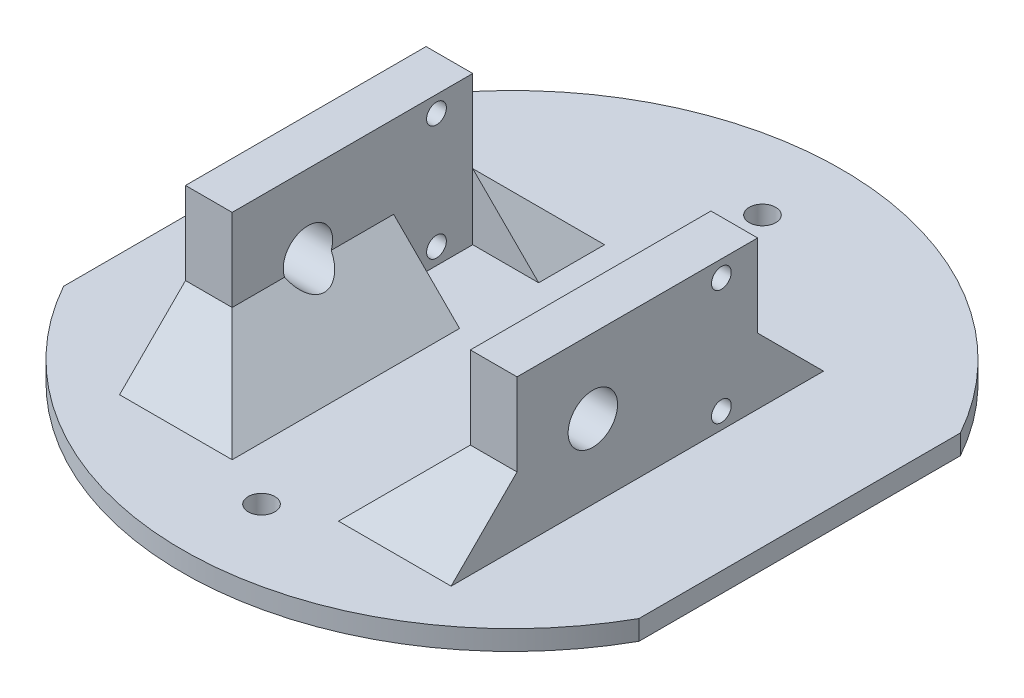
ISO-10303-21;
HEADER;
FILE_DESCRIPTION(('STEP AP214'),'2;1');
FILE_NAME('part.step','',(''),(''),'','','');
FILE_SCHEMA(('AUTOMOTIVE_DESIGN { 1 0 10303 214 1 1 1 1 }'));
ENDSEC;
DATA;
#1=APPLICATION_CONTEXT('core data for automotive mechanical design processes');
#2=APPLICATION_PROTOCOL_DEFINITION('international standard','automotive_design',2000,#1);
#3=PRODUCT_CONTEXT('',#1,'mechanical');
#4=PRODUCT('Part','Part','',(#3));
#5=PRODUCT_RELATED_PRODUCT_CATEGORY('part','',(#4));
#6=PRODUCT_DEFINITION_FORMATION('','',#4);
#7=PRODUCT_DEFINITION_CONTEXT('part definition',#1,'design');
#8=PRODUCT_DEFINITION('design','',#6,#7);
#9=PRODUCT_DEFINITION_SHAPE('','',#8);
#10=(LENGTH_UNIT() NAMED_UNIT(*) SI_UNIT(.MILLI.,.METRE.));
#11=(NAMED_UNIT(*) PLANE_ANGLE_UNIT() SI_UNIT($,.RADIAN.));
#12=(NAMED_UNIT(*) SI_UNIT($,.STERADIAN.) SOLID_ANGLE_UNIT());
#13=UNCERTAINTY_MEASURE_WITH_UNIT(LENGTH_MEASURE(1.E-05),#10,'distance_accuracy_value','');
#14=(GEOMETRIC_REPRESENTATION_CONTEXT(3) GLOBAL_UNCERTAINTY_ASSIGNED_CONTEXT((#13)) GLOBAL_UNIT_ASSIGNED_CONTEXT((#10,
#11,#12)) REPRESENTATION_CONTEXT('',''));
#15=CARTESIAN_POINT('',(0.,0.,0.));
#16=DIRECTION('',(0.,0.,1.));
#17=DIRECTION('',(1.,0.,0.));
#18=AXIS2_PLACEMENT_3D('',#15,#16,#17);
#19=CARTESIAN_POINT('',(43.65,5.49999999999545,-6.61398966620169));
#20=DIRECTION('',(-1.,0.,0.));
#21=DIRECTION('',(0.,0.,1.));
#22=AXIS2_PLACEMENT_3D('',#19,#20,#21);
#23=CYLINDRICAL_SURFACE('',#22,1.49999999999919);
#24=CARTESIAN_POINT('',(25.15,5.49999999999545,-6.61398966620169));
#25=DIRECTION('',(-1.,0.,0.));
#26=DIRECTION('',(0.,0.,1.));
#27=AXIS2_PLACEMENT_3D('',#24,#25,#26);
#28=CIRCLE('',#27,1.49999999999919);
#29=CARTESIAN_POINT('',(25.15,5.49999999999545,-5.1139896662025));
#30=VERTEX_POINT('',#29);
#31=EDGE_CURVE('E352',#30,#30,#28,.T.);
#32=ORIENTED_EDGE('',*,*,#31,.F.);
#33=EDGE_LOOP('',(#32));
#34=FACE_BOUND('',#33,.T.);
#35=CARTESIAN_POINT('',(18.07,5.49999999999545,-6.61398966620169));
#36=DIRECTION('',(-1.,0.,0.));
#37=DIRECTION('',(0.,0.,1.));
#38=AXIS2_PLACEMENT_3D('',#35,#36,#37);
#39=CIRCLE('',#38,1.49999999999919);
#40=CARTESIAN_POINT('',(18.07,5.49999999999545,-5.1139896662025));
#41=VERTEX_POINT('',#40);
#42=EDGE_CURVE('E322',#41,#41,#39,.F.);
#43=ORIENTED_EDGE('',*,*,#42,.F.);
#44=EDGE_LOOP('',(#43));
#45=FACE_BOUND('',#44,.T.);
#46=ADVANCED_FACE('F35',(#34,#45),#23,.F.);
#47=CARTESIAN_POINT('',(-25.15,5.49999999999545,-6.61398966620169));
#48=DIRECTION('',(1.,0.,0.));
#49=DIRECTION('',(0.,0.,-1.));
#50=AXIS2_PLACEMENT_3D('',#47,#48,#49);
#51=CIRCLE('',#50,1.49999999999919);
#52=CARTESIAN_POINT('',(-25.15,5.49999999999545,-8.11398966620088));
#53=VERTEX_POINT('',#52);
#54=EDGE_CURVE('E355',#53,#53,#51,.T.);
#55=ORIENTED_EDGE('',*,*,#54,.F.);
#56=EDGE_LOOP('',(#55));
#57=FACE_BOUND('',#56,.T.);
#58=CARTESIAN_POINT('',(-18.07,5.49999999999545,-6.61398966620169));
#59=DIRECTION('',(1.,0.,0.));
#60=DIRECTION('',(0.,0.,-1.));
#61=AXIS2_PLACEMENT_3D('',#58,#59,#60);
#62=CIRCLE('',#61,1.49999999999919);
#63=CARTESIAN_POINT('',(-18.07,5.49999999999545,-8.11398966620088));
#64=VERTEX_POINT('',#63);
#65=EDGE_CURVE('E232',#64,#64,#62,.F.);
#66=ORIENTED_EDGE('',*,*,#65,.F.);
#67=EDGE_LOOP('',(#66));
#68=FACE_BOUND('',#67,.T.);
#69=ADVANCED_FACE('F455',(#57,#68),#23,.F.);
#70=CARTESIAN_POINT('',(-18.07,13.0000000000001,24.3860103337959));
#71=DIRECTION('',(-0.707106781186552,-0.707106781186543,0.));
#72=DIRECTION('',(0.,0.,-1.));
#73=AXIS2_PLACEMENT_3D('',#70,#71,#72);
#74=PLANE('',#73);
#75=DIRECTION('',(-0.707106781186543,0.707106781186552,0.));
#76=VECTOR('',#75,1.);
#77=CARTESIAN_POINT('',(-18.07,13.0000000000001,-12.1139896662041));
#78=LINE('',#77,#76);
#79=CARTESIAN_POINT('',(-8.07000000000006,3.,-12.1139896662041));
#80=VERTEX_POINT('',#79);
#81=CARTESIAN_POINT('',(-18.07,13.0000000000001,-12.1139896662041));
#82=VERTEX_POINT('',#81);
#83=EDGE_CURVE('E339',#80,#82,#78,.T.);
#84=ORIENTED_EDGE('',*,*,#83,.F.);
#85=DIRECTION('',(0.,0.,1.));
#86=VECTOR('',#85,1.);
#87=CARTESIAN_POINT('',(-8.07000000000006,3.,0.));
#88=LINE('',#87,#86);
#89=CARTESIAN_POINT('',(-8.07000000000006,3.,-22.113989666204));
#90=VERTEX_POINT('',#89);
#91=EDGE_CURVE('E265',#90,#80,#88,.T.);
#92=ORIENTED_EDGE('',*,*,#91,.F.);
#93=DIRECTION('',(-0.577350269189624,0.57735026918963,0.577350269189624));
#94=VECTOR('',#93,1.);
#95=CARTESIAN_POINT('',(-30.2366666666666,25.1666666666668,0.0526770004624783));
#96=LINE('',#95,#94);
#97=EDGE_CURVE('E224',#90,#82,#96,.T.);
#98=ORIENTED_EDGE('',*,*,#97,.T.);
#99=EDGE_LOOP('',(#84,#92,#98));
#100=FACE_BOUND('',#99,.T.);
#101=ADVANCED_FACE('F461',(#100),#74,.F.);
#102=DIRECTION('',(0.,0.,-1.));
#103=VECTOR('',#102,1.);
#104=CARTESIAN_POINT('',(-18.07,13.0000000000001,24.3860103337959));
#105=LINE('',#104,#103);
#106=CARTESIAN_POINT('',(-18.07,13.0000000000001,9.35047642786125));
#107=VERTEX_POINT('',#106);
#108=CARTESIAN_POINT('',(-18.07,13.0000000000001,-0.113989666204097));
#109=VERTEX_POINT('',#108);
#110=EDGE_CURVE('E275',#107,#109,#105,.T.);
#111=ORIENTED_EDGE('',*,*,#110,.F.);
#112=CARTESIAN_POINT('',(-19.3199999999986,14.2499999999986,12.8860103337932));
#113=DIRECTION('',(-0.707106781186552,-0.707106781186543,0.));
#114=DIRECTION('',(0.707106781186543,-0.707106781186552,0.));
#115=AXIS2_PLACEMENT_3D('',#112,#113,#114);
#116=ELLIPSE('',#115,5.30330085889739,3.74999999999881);
#117=CARTESIAN_POINT('',(-18.07,13.0000000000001,16.4215442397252));
#118=VERTEX_POINT('',#117);
#119=EDGE_CURVE('E49',#107,#118,#116,.T.);
#120=ORIENTED_EDGE('',*,*,#119,.T.);
#121=CARTESIAN_POINT('',(-18.07,13.0000000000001,24.3860103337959));
#122=VERTEX_POINT('',#121);
#123=EDGE_CURVE('E276',#122,#118,#105,.T.);
#124=ORIENTED_EDGE('',*,*,#123,.F.);
#125=DIRECTION('',(0.577350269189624,-0.57735026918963,0.577350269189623));
#126=VECTOR('',#125,1.);
#127=CARTESIAN_POINT('',(-18.07,13.0000000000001,24.3860103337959));
#128=LINE('',#127,#126);
#129=CARTESIAN_POINT('',(-8.07000000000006,3.,34.3860103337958));
#130=VERTEX_POINT('',#129);
#131=EDGE_CURVE('E222',#130,#122,#128,.F.);
#132=ORIENTED_EDGE('',*,*,#131,.F.);
#133=CARTESIAN_POINT('',(-8.07000000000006,3.,-0.113989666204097));
#134=VERTEX_POINT('',#133);
#135=EDGE_CURVE('E264',#134,#130,#88,.T.);
#136=ORIENTED_EDGE('',*,*,#135,.F.);
#137=DIRECTION('',(0.707106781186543,-0.707106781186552,0.));
#138=VECTOR('',#137,1.);
#139=CARTESIAN_POINT('',(-18.07,13.0000000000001,-0.113989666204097));
#140=LINE('',#139,#138);
#141=EDGE_CURVE('E336',#109,#134,#140,.T.);
#142=ORIENTED_EDGE('',*,*,#141,.F.);
#143=EDGE_LOOP('',(#111,#120,#124,#132,#136,#142));
#144=FACE_BOUND('',#143,.T.);
#145=ADVANCED_FACE('F649',(#144),#74,.F.);
#146=CARTESIAN_POINT('',(18.07,13.0000000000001,24.3860103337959));
#147=DIRECTION('',(0.707106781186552,-0.707106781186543,0.));
#148=DIRECTION('',(0.,0.,1.));
#149=AXIS2_PLACEMENT_3D('',#146,#147,#148);
#150=PLANE('',#149);
#151=DIRECTION('',(-0.707106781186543,-0.707106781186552,0.));
#152=VECTOR('',#151,1.);
#153=CARTESIAN_POINT('',(18.07,13.0000000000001,-12.1139896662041));
#154=LINE('',#153,#152);
#155=CARTESIAN_POINT('',(18.07,13.0000000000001,-12.1139896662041));
#156=VERTEX_POINT('',#155);
#157=CARTESIAN_POINT('',(8.07000000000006,3.,-12.1139896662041));
#158=VERTEX_POINT('',#157);
#159=EDGE_CURVE('E43',#156,#158,#154,.T.);
#160=ORIENTED_EDGE('',*,*,#159,.F.);
#161=DIRECTION('',(-0.577350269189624,-0.57735026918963,-0.577350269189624));
#162=VECTOR('',#161,1.);
#163=CARTESIAN_POINT('',(30.2366666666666,25.1666666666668,0.0526770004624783));
#164=LINE('',#163,#162);
#165=CARTESIAN_POINT('',(8.07000000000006,3.,-22.113989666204));
#166=VERTEX_POINT('',#165);
#167=EDGE_CURVE('E225',#156,#166,#164,.T.);
#168=ORIENTED_EDGE('',*,*,#167,.T.);
#169=DIRECTION('',(0.,0.,-1.));
#170=VECTOR('',#169,1.);
#171=CARTESIAN_POINT('',(8.07000000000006,3.,0.));
#172=LINE('',#171,#170);
#173=EDGE_CURVE('E246',#158,#166,#172,.T.);
#174=ORIENTED_EDGE('',*,*,#173,.F.);
#175=EDGE_LOOP('',(#160,#168,#174));
#176=FACE_BOUND('',#175,.T.);
#177=ADVANCED_FACE('F37',(#176),#150,.F.);
#178=DIRECTION('',(0.,0.,1.));
#179=VECTOR('',#178,1.);
#180=CARTESIAN_POINT('',(18.07,13.0000000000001,24.3860103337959));
#181=LINE('',#180,#179);
#182=CARTESIAN_POINT('',(18.07,13.0000000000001,16.4215442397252));
#183=VERTEX_POINT('',#182);
#184=CARTESIAN_POINT('',(18.07,13.0000000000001,24.3860103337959));
#185=VERTEX_POINT('',#184);
#186=EDGE_CURVE('E196',#183,#185,#181,.T.);
#187=ORIENTED_EDGE('',*,*,#186,.F.);
#188=CARTESIAN_POINT('',(19.3199999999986,14.2499999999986,12.8860103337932));
#189=DIRECTION('',(0.707106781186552,-0.707106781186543,0.));
#190=DIRECTION('',(0.707106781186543,0.707106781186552,0.));
#191=AXIS2_PLACEMENT_3D('',#188,#189,#190);
#192=ELLIPSE('',#191,5.30330085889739,3.74999999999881);
#193=CARTESIAN_POINT('',(18.07,13.0000000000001,9.35047642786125));
#194=VERTEX_POINT('',#193);
#195=EDGE_CURVE('E56',#183,#194,#192,.T.);
#196=ORIENTED_EDGE('',*,*,#195,.T.);
#197=CARTESIAN_POINT('',(18.07,13.0000000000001,-0.113989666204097));
#198=VERTEX_POINT('',#197);
#199=EDGE_CURVE('E194',#198,#194,#181,.T.);
#200=ORIENTED_EDGE('',*,*,#199,.F.);
#201=DIRECTION('',(0.707106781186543,0.707106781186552,0.));
#202=VECTOR('',#201,1.);
#203=CARTESIAN_POINT('',(18.07,13.0000000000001,-0.113989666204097));
#204=LINE('',#203,#202);
#205=CARTESIAN_POINT('',(8.07000000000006,3.,-0.113989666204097));
#206=VERTEX_POINT('',#205);
#207=EDGE_CURVE('E221',#206,#198,#204,.T.);
#208=ORIENTED_EDGE('',*,*,#207,.F.);
#209=CARTESIAN_POINT('',(8.07000000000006,3.,34.3860103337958));
#210=VERTEX_POINT('',#209);
#211=EDGE_CURVE('E251',#210,#206,#172,.T.);
#212=ORIENTED_EDGE('',*,*,#211,.F.);
#213=DIRECTION('',(0.577350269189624,0.57735026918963,-0.577350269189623));
#214=VECTOR('',#213,1.);
#215=CARTESIAN_POINT('',(18.07,13.0000000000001,24.3860103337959));
#216=LINE('',#215,#214);
#217=EDGE_CURVE('E229',#185,#210,#216,.F.);
#218=ORIENTED_EDGE('',*,*,#217,.F.);
#219=EDGE_LOOP('',(#187,#196,#200,#208,#212,#218));
#220=FACE_BOUND('',#219,.T.);
#221=ADVANCED_FACE('F192',(#220),#150,.F.);
#222=CARTESIAN_POINT('',(0.,3.,0.));
#223=DIRECTION('',(0.,1.,0.));
#224=DIRECTION('',(0.,0.,1.));
#225=AXIS2_PLACEMENT_3D('',#222,#223,#224);
#226=PLANE('',#225);
#227=DIRECTION('',(-1.,0.,0.));
#228=VECTOR('',#227,1.);
#229=CARTESIAN_POINT('',(18.07,3.,-12.1139896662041));
#230=LINE('',#229,#228);
#231=CARTESIAN_POINT('',(18.07,3.,-12.1139896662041));
#232=VERTEX_POINT('',#231);
#233=EDGE_CURVE('E240',#232,#158,#230,.T.);
#234=ORIENTED_EDGE('',*,*,#233,.T.);
#235=ORIENTED_EDGE('',*,*,#173,.T.);
#236=DIRECTION('',(1.,0.,0.));
#237=VECTOR('',#236,1.);
#238=CARTESIAN_POINT('',(0.,3.,-22.113989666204));
#239=LINE('',#238,#237);
#240=CARTESIAN_POINT('',(25.15,3.,-22.113989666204));
#241=VERTEX_POINT('',#240);
#242=EDGE_CURVE('E255',#166,#241,#239,.T.);
#243=ORIENTED_EDGE('',*,*,#242,.T.);
#244=DIRECTION('',(0.,0.,-1.));
#245=VECTOR('',#244,1.);
#246=CARTESIAN_POINT('',(25.15,3.,24.3860103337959));
#247=LINE('',#246,#245);
#248=CARTESIAN_POINT('',(25.15,3.,34.3860103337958));
#249=VERTEX_POINT('',#248);
#250=EDGE_CURVE('E304',#249,#241,#247,.T.);
#251=ORIENTED_EDGE('',*,*,#250,.F.);
#252=DIRECTION('',(-1.,0.,0.));
#253=VECTOR('',#252,1.);
#254=CARTESIAN_POINT('',(0.,3.,34.3860103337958));
#255=LINE('',#254,#253);
#256=EDGE_CURVE('E262',#249,#210,#255,.T.);
#257=ORIENTED_EDGE('',*,*,#256,.T.);
#258=ORIENTED_EDGE('',*,*,#211,.T.);
#259=DIRECTION('',(1.,0.,0.));
#260=VECTOR('',#259,1.);
#261=CARTESIAN_POINT('',(18.07,3.,-0.113989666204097));
#262=LINE('',#261,#260);
#263=CARTESIAN_POINT('',(18.07,3.,-0.113989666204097));
#264=VERTEX_POINT('',#263);
#265=EDGE_CURVE('E316',#206,#264,#262,.T.);
#266=ORIENTED_EDGE('',*,*,#265,.T.);
#267=DIRECTION('',(0.,0.,-1.));
#268=VECTOR('',#267,1.);
#269=CARTESIAN_POINT('',(18.07,3.,-12.1139896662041));
#270=LINE('',#269,#268);
#271=EDGE_CURVE('E317',#264,#232,#270,.T.);
#272=ORIENTED_EDGE('',*,*,#271,.T.);
#273=EDGE_LOOP('',(#234,#235,#243,#251,#257,#258,#266,#272));
#274=FACE_BOUND('',#273,.T.);
#275=ORIENTED_EDGE('',*,*,#91,.T.);
#276=CARTESIAN_POINT('',(-18.07,3.,-12.1139896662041));
#277=VERTEX_POINT('',#276);
#278=EDGE_CURVE('E325',#80,#277,#230,.T.);
#279=ORIENTED_EDGE('',*,*,#278,.T.);
#280=DIRECTION('',(0.,0.,1.));
#281=VECTOR('',#280,1.);
#282=CARTESIAN_POINT('',(-18.07,3.,-12.1139896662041));
#283=LINE('',#282,#281);
#284=CARTESIAN_POINT('',(-18.07,3.,-0.113989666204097));
#285=VERTEX_POINT('',#284);
#286=EDGE_CURVE('E320',#277,#285,#283,.T.);
#287=ORIENTED_EDGE('',*,*,#286,.T.);
#288=EDGE_CURVE('E319',#285,#134,#262,.T.);
#289=ORIENTED_EDGE('',*,*,#288,.T.);
#290=ORIENTED_EDGE('',*,*,#135,.T.);
#291=DIRECTION('',(-1.,0.,0.));
#292=VECTOR('',#291,1.);
#293=CARTESIAN_POINT('',(0.,3.,34.3860103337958));
#294=LINE('',#293,#292);
#295=CARTESIAN_POINT('',(-25.15,3.,34.3860103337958));
#296=VERTEX_POINT('',#295);
#297=EDGE_CURVE('E270',#130,#296,#294,.T.);
#298=ORIENTED_EDGE('',*,*,#297,.T.);
#299=DIRECTION('',(0.,0.,1.));
#300=VECTOR('',#299,1.);
#301=CARTESIAN_POINT('',(-25.15,3.,24.3860103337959));
#302=LINE('',#301,#300);
#303=CARTESIAN_POINT('',(-25.15,3.,-22.113989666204));
#304=VERTEX_POINT('',#303);
#305=EDGE_CURVE('E379',#304,#296,#302,.T.);
#306=ORIENTED_EDGE('',*,*,#305,.F.);
#307=DIRECTION('',(1.,0.,0.));
#308=VECTOR('',#307,1.);
#309=CARTESIAN_POINT('',(0.,3.,-22.113989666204));
#310=LINE('',#309,#308);
#311=EDGE_CURVE('E268',#304,#90,#310,.T.);
#312=ORIENTED_EDGE('',*,*,#311,.T.);
#313=EDGE_LOOP('',(#275,#279,#287,#289,#290,#298,#306,#312));
#314=FACE_BOUND('',#313,.T.);
#315=CARTESIAN_POINT('',(0.,3.,-38.));
#316=DIRECTION('',(0.,1.,0.));
#317=DIRECTION('',(0.,0.,1.));
#318=AXIS2_PLACEMENT_3D('',#315,#316,#317);
#319=CIRCLE('',#318,2.01929999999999);
#320=CARTESIAN_POINT('',(0.,3.,-35.9807));
#321=VERTEX_POINT('',#320);
#322=EDGE_CURVE('E358',#321,#321,#319,.T.);
#323=ORIENTED_EDGE('',*,*,#322,.F.);
#324=EDGE_LOOP('',(#323));
#325=FACE_BOUND('',#324,.T.);
#326=CARTESIAN_POINT('',(0.,3.,38.));
#327=DIRECTION('',(0.,1.,0.));
#328=DIRECTION('',(0.,0.,1.));
#329=AXIS2_PLACEMENT_3D('',#326,#327,#328);
#330=CIRCLE('',#329,2.01929999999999);
#331=CARTESIAN_POINT('',(0.,3.,40.0193));
#332=VERTEX_POINT('',#331);
#333=EDGE_CURVE('E364',#332,#332,#330,.T.);
#334=ORIENTED_EDGE('',*,*,#333,.F.);
#335=EDGE_LOOP('',(#334));
#336=FACE_BOUND('',#335,.T.);
#337=DIRECTION('',(0.,0.,-1.));
#338=VECTOR('',#337,1.);
#339=CARTESIAN_POINT('',(-43.65,3.,-24.3860103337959));
#340=LINE('',#339,#338);
#341=CARTESIAN_POINT('',(-43.65,3.,24.3860103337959));
#342=VERTEX_POINT('',#341);
#343=CARTESIAN_POINT('',(-43.65,3.,-24.3860103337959));
#344=VERTEX_POINT('',#343);
#345=EDGE_CURVE('E403',#342,#344,#340,.T.);
#346=ORIENTED_EDGE('',*,*,#345,.F.);
#347=CARTESIAN_POINT('',(0.,3.,0.));
#348=DIRECTION('',(0.,1.,0.));
#349=DIRECTION('',(0.,0.,1.));
#350=AXIS2_PLACEMENT_3D('',#347,#348,#349);
#351=CIRCLE('',#350,50.);
#352=CARTESIAN_POINT('',(43.65,3.,24.3860103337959));
#353=VERTEX_POINT('',#352);
#354=EDGE_CURVE('E417',#342,#353,#351,.T.);
#355=ORIENTED_EDGE('',*,*,#354,.T.);
#356=DIRECTION('',(0.,0.,1.));
#357=VECTOR('',#356,1.);
#358=CARTESIAN_POINT('',(43.65,3.,-24.3860103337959));
#359=LINE('',#358,#357);
#360=CARTESIAN_POINT('',(43.65,3.,-24.3860103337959));
#361=VERTEX_POINT('',#360);
#362=EDGE_CURVE('E402',#361,#353,#359,.T.);
#363=ORIENTED_EDGE('',*,*,#362,.F.);
#364=EDGE_CURVE('E420',#361,#344,#351,.T.);
#365=ORIENTED_EDGE('',*,*,#364,.T.);
#366=EDGE_LOOP('',(#346,#355,#363,#365));
#367=FACE_BOUND('',#366,.T.);
#368=ADVANCED_FACE('F302',(#274,#314,#325,#336,#367),#226,.T.);
#369=CARTESIAN_POINT('',(0.,3.,0.));
#370=DIRECTION('',(0.,-1.,0.));
#371=DIRECTION('',(0.,0.,-1.));
#372=AXIS2_PLACEMENT_3D('',#369,#370,#371);
#373=CYLINDRICAL_SURFACE('',#372,50.);
#374=CARTESIAN_POINT('',(0.,0.,0.));
#375=DIRECTION('',(0.,1.,0.));
#376=DIRECTION('',(0.,0.,1.));
#377=AXIS2_PLACEMENT_3D('',#374,#375,#376);
#378=CIRCLE('',#377,50.);
#379=CARTESIAN_POINT('',(43.65,0.,-24.3860103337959));
#380=VERTEX_POINT('',#379);
#381=CARTESIAN_POINT('',(-43.65,0.,-24.3860103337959));
#382=VERTEX_POINT('',#381);
#383=EDGE_CURVE('E421',#380,#382,#378,.T.);
#384=ORIENTED_EDGE('',*,*,#383,.T.);
#385=DIRECTION('',(0.,1.,0.));
#386=VECTOR('',#385,1.);
#387=CARTESIAN_POINT('',(-43.65,-35.1,-24.3860103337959));
#388=LINE('',#387,#386);
#389=EDGE_CURVE('E407',#382,#344,#388,.T.);
#390=ORIENTED_EDGE('',*,*,#389,.T.);
#391=ORIENTED_EDGE('',*,*,#364,.F.);
#392=DIRECTION('',(0.,1.,0.));
#393=VECTOR('',#392,1.);
#394=CARTESIAN_POINT('',(43.65,-35.1,-24.3860103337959));
#395=LINE('',#394,#393);
#396=EDGE_CURVE('E413',#380,#361,#395,.T.);
#397=ORIENTED_EDGE('',*,*,#396,.F.);
#398=EDGE_LOOP('',(#384,#390,#391,#397));
#399=FACE_BOUND('',#398,.T.);
#400=ADVANCED_FACE('F626',(#399),#373,.T.);
#401=ORIENTED_EDGE('',*,*,#354,.F.);
#402=DIRECTION('',(0.,1.,0.));
#403=VECTOR('',#402,1.);
#404=CARTESIAN_POINT('',(-43.65,-35.1,24.3860103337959));
#405=LINE('',#404,#403);
#406=CARTESIAN_POINT('',(-43.65,0.,24.3860103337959));
#407=VERTEX_POINT('',#406);
#408=EDGE_CURVE('E405',#407,#342,#405,.T.);
#409=ORIENTED_EDGE('',*,*,#408,.F.);
#410=CARTESIAN_POINT('',(43.65,0.,24.3860103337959));
#411=VERTEX_POINT('',#410);
#412=EDGE_CURVE('E410',#407,#411,#378,.T.);
#413=ORIENTED_EDGE('',*,*,#412,.T.);
#414=DIRECTION('',(0.,1.,0.));
#415=VECTOR('',#414,1.);
#416=CARTESIAN_POINT('',(43.65,-35.1,24.3860103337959));
#417=LINE('',#416,#415);
#418=EDGE_CURVE('E406',#411,#353,#417,.T.);
#419=ORIENTED_EDGE('',*,*,#418,.T.);
#420=EDGE_LOOP('',(#401,#409,#413,#419));
#421=FACE_BOUND('',#420,.T.);
#422=ADVANCED_FACE('F740',(#421),#373,.T.);
#423=CARTESIAN_POINT('',(0.,0.,0.));
#424=DIRECTION('',(0.,1.,0.));
#425=DIRECTION('',(0.,0.,1.));
#426=AXIS2_PLACEMENT_3D('',#423,#424,#425);
#427=PLANE('',#426);
#428=CARTESIAN_POINT('',(0.,0.,-38.));
#429=DIRECTION('',(0.,1.,0.));
#430=DIRECTION('',(0.,0.,1.));
#431=AXIS2_PLACEMENT_3D('',#428,#429,#430);
#432=CIRCLE('',#431,2.01929999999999);
#433=CARTESIAN_POINT('',(0.,0.,-35.9807));
#434=VERTEX_POINT('',#433);
#435=EDGE_CURVE('E361',#434,#434,#432,.T.);
#436=ORIENTED_EDGE('',*,*,#435,.T.);
#437=EDGE_LOOP('',(#436));
#438=FACE_BOUND('',#437,.T.);
#439=CARTESIAN_POINT('',(0.,0.,38.));
#440=DIRECTION('',(0.,1.,0.));
#441=DIRECTION('',(0.,0.,1.));
#442=AXIS2_PLACEMENT_3D('',#439,#440,#441);
#443=CIRCLE('',#442,2.01929999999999);
#444=CARTESIAN_POINT('',(0.,0.,40.0193));
#445=VERTEX_POINT('',#444);
#446=EDGE_CURVE('E309',#445,#445,#443,.T.);
#447=ORIENTED_EDGE('',*,*,#446,.T.);
#448=EDGE_LOOP('',(#447));
#449=FACE_BOUND('',#448,.T.);
#450=ORIENTED_EDGE('',*,*,#412,.F.);
#451=DIRECTION('',(0.,0.,-1.));
#452=VECTOR('',#451,1.);
#453=CARTESIAN_POINT('',(-43.65,0.,0.));
#454=LINE('',#453,#452);
#455=EDGE_CURVE('E257',#407,#382,#454,.T.);
#456=ORIENTED_EDGE('',*,*,#455,.T.);
#457=ORIENTED_EDGE('',*,*,#383,.F.);
#458=DIRECTION('',(0.,0.,1.));
#459=VECTOR('',#458,1.);
#460=CARTESIAN_POINT('',(43.65,0.,0.));
#461=LINE('',#460,#459);
#462=EDGE_CURVE('E424',#380,#411,#461,.T.);
#463=ORIENTED_EDGE('',*,*,#462,.T.);
#464=EDGE_LOOP('',(#450,#456,#457,#463));
#465=FACE_BOUND('',#464,.T.);
#466=ADVANCED_FACE('F732',(#438,#449,#465),#427,.F.);
#467=CARTESIAN_POINT('',(43.65,-35.1,-24.3860103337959));
#468=DIRECTION('',(-1.,0.,0.));
#469=DIRECTION('',(0.,0.,1.));
#470=AXIS2_PLACEMENT_3D('',#467,#468,#469);
#471=PLANE('',#470);
#472=ORIENTED_EDGE('',*,*,#396,.T.);
#473=ORIENTED_EDGE('',*,*,#362,.T.);
#474=ORIENTED_EDGE('',*,*,#418,.F.);
#475=ORIENTED_EDGE('',*,*,#462,.F.);
#476=EDGE_LOOP('',(#472,#473,#474,#475));
#477=FACE_BOUND('',#476,.T.);
#478=ADVANCED_FACE('F724',(#477),#471,.F.);
#479=CARTESIAN_POINT('',(-43.65,-35.1,-24.3860103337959));
#480=DIRECTION('',(1.,0.,0.));
#481=DIRECTION('',(0.,0.,-1.));
#482=AXIS2_PLACEMENT_3D('',#479,#480,#481);
#483=PLANE('',#482);
#484=ORIENTED_EDGE('',*,*,#408,.T.);
#485=ORIENTED_EDGE('',*,*,#345,.T.);
#486=ORIENTED_EDGE('',*,*,#389,.F.);
#487=ORIENTED_EDGE('',*,*,#455,.F.);
#488=EDGE_LOOP('',(#484,#485,#486,#487));
#489=FACE_BOUND('',#488,.T.);
#490=ADVANCED_FACE('F695',(#489),#483,.F.);
#491=CARTESIAN_POINT('',(-25.15,25.5,24.3860103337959));
#492=DIRECTION('',(1.,0.,0.));
#493=DIRECTION('',(0.,0.,-1.));
#494=AXIS2_PLACEMENT_3D('',#491,#492,#493);
#495=PLANE('',#494);
#496=CARTESIAN_POINT('',(-25.15,14.2499999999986,12.8860103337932));
#497=DIRECTION('',(1.,0.,0.));
#498=DIRECTION('',(0.,0.,-1.));
#499=AXIS2_PLACEMENT_3D('',#496,#497,#498);
#500=CIRCLE('',#499,3.74999999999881);
#501=CARTESIAN_POINT('',(-25.15,14.2499999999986,9.13601033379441));
#502=VERTEX_POINT('',#501);
#503=EDGE_CURVE('E198',#502,#502,#500,.F.);
#504=ORIENTED_EDGE('',*,*,#503,.F.);
#505=EDGE_LOOP('',(#504));
#506=FACE_BOUND('',#505,.T.);
#507=ORIENTED_EDGE('',*,*,#54,.T.);
#508=EDGE_LOOP('',(#507));
#509=FACE_BOUND('',#508,.T.);
#510=CARTESIAN_POINT('',(-25.15,22.9999999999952,-6.61398966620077));
#511=DIRECTION('',(1.,0.,0.));
#512=DIRECTION('',(0.,0.,-1.));
#513=AXIS2_PLACEMENT_3D('',#510,#511,#512);
#514=CIRCLE('',#513,1.49999999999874);
#515=CARTESIAN_POINT('',(-25.15,22.9999999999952,-5.11398966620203));
#516=VERTEX_POINT('',#515);
#517=EDGE_CURVE('E349',#516,#516,#514,.T.);
#518=ORIENTED_EDGE('',*,*,#517,.T.);
#519=EDGE_LOOP('',(#518));
#520=FACE_BOUND('',#519,.T.);
#521=ORIENTED_EDGE('',*,*,#305,.T.);
#522=DIRECTION('',(0.,0.707106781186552,-0.707106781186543));
#523=VECTOR('',#522,1.);
#524=CARTESIAN_POINT('',(-25.15,19.2500000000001,18.1360103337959));
#525=LINE('',#524,#523);
#526=CARTESIAN_POINT('',(-25.15,13.0000000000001,24.3860103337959));
#527=VERTEX_POINT('',#526);
#528=EDGE_CURVE('E206',#296,#527,#525,.T.);
#529=ORIENTED_EDGE('',*,*,#528,.T.);
#530=DIRECTION('',(0.,-1.,0.));
#531=VECTOR('',#530,1.);
#532=CARTESIAN_POINT('',(-25.15,25.5,24.3860103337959));
#533=LINE('',#532,#531);
#534=CARTESIAN_POINT('',(-25.15,25.5,24.3860103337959));
#535=VERTEX_POINT('',#534);
#536=EDGE_CURVE('E399',#535,#527,#533,.T.);
#537=ORIENTED_EDGE('',*,*,#536,.F.);
#538=DIRECTION('',(0.,0.,1.));
#539=VECTOR('',#538,1.);
#540=CARTESIAN_POINT('',(-25.15,25.5,24.3860103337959));
#541=LINE('',#540,#539);
#542=CARTESIAN_POINT('',(-25.15,25.5,-12.1139896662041));
#543=VERTEX_POINT('',#542);
#544=EDGE_CURVE('E380',#543,#535,#541,.T.);
#545=ORIENTED_EDGE('',*,*,#544,.F.);
#546=DIRECTION('',(0.,-1.,0.));
#547=VECTOR('',#546,1.);
#548=CARTESIAN_POINT('',(-25.15,25.5,-12.1139896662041));
#549=LINE('',#548,#547);
#550=CARTESIAN_POINT('',(-25.15,13.0000000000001,-12.1139896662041));
#551=VERTEX_POINT('',#550);
#552=EDGE_CURVE('E389',#543,#551,#549,.T.);
#553=ORIENTED_EDGE('',*,*,#552,.T.);
#554=DIRECTION('',(0.,-0.707106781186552,-0.707106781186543));
#555=VECTOR('',#554,1.);
#556=CARTESIAN_POINT('',(-25.15,37.5000000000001,12.3860103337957));
#557=LINE('',#556,#555);
#558=EDGE_CURVE('E208',#551,#304,#557,.T.);
#559=ORIENTED_EDGE('',*,*,#558,.T.);
#560=EDGE_LOOP('',(#521,#529,#537,#545,#553,#559));
#561=FACE_BOUND('',#560,.T.);
#562=ADVANCED_FACE('F692',(#506,#509,#520,#561),#495,.F.);
#563=CARTESIAN_POINT('',(-25.15,25.5,24.3860103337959));
#564=DIRECTION('',(0.,0.,-1.));
#565=DIRECTION('',(-1.,0.,0.));
#566=AXIS2_PLACEMENT_3D('',#563,#564,#565);
#567=PLANE('',#566);
#568=ORIENTED_EDGE('',*,*,#536,.T.);
#569=DIRECTION('',(1.,0.,0.));
#570=VECTOR('',#569,1.);
#571=CARTESIAN_POINT('',(-25.15,13.0000000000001,24.3860103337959));
#572=LINE('',#571,#570);
#573=EDGE_CURVE('E252',#527,#122,#572,.T.);
#574=ORIENTED_EDGE('',*,*,#573,.T.);
#575=DIRECTION('',(0.,-1.,0.));
#576=VECTOR('',#575,1.);
#577=CARTESIAN_POINT('',(-18.07,25.5,24.3860103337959));
#578=LINE('',#577,#576);
#579=CARTESIAN_POINT('',(-18.07,25.5,24.3860103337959));
#580=VERTEX_POINT('',#579);
#581=EDGE_CURVE('E396',#580,#122,#578,.T.);
#582=ORIENTED_EDGE('',*,*,#581,.F.);
#583=DIRECTION('',(1.,0.,0.));
#584=VECTOR('',#583,1.);
#585=CARTESIAN_POINT('',(-25.15,25.5,24.3860103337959));
#586=LINE('',#585,#584);
#587=EDGE_CURVE('E383',#535,#580,#586,.T.);
#588=ORIENTED_EDGE('',*,*,#587,.F.);
#589=EDGE_LOOP('',(#568,#574,#582,#588));
#590=FACE_BOUND('',#589,.T.);
#591=ADVANCED_FACE('F611',(#590),#567,.F.);
#592=CARTESIAN_POINT('',(-18.07,25.5,24.3860103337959));
#593=DIRECTION('',(-1.,0.,0.));
#594=DIRECTION('',(0.,0.,1.));
#595=AXIS2_PLACEMENT_3D('',#592,#593,#594);
#596=PLANE('',#595);
#597=CARTESIAN_POINT('',(-18.07,22.9999999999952,-6.61398966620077));
#598=DIRECTION('',(-1.,0.,0.));
#599=DIRECTION('',(0.,0.,1.));
#600=AXIS2_PLACEMENT_3D('',#597,#598,#599);
#601=CIRCLE('',#600,1.49999999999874);
#602=CARTESIAN_POINT('',(-18.07,22.9999999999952,-5.11398966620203));
#603=VERTEX_POINT('',#602);
#604=EDGE_CURVE('E346',#603,#603,#601,.T.);
#605=ORIENTED_EDGE('',*,*,#604,.T.);
#606=EDGE_LOOP('',(#605));
#607=FACE_BOUND('',#606,.T.);
#608=ORIENTED_EDGE('',*,*,#123,.T.);
#609=CARTESIAN_POINT('',(-18.07,14.2499999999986,12.8860103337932));
#610=DIRECTION('',(-1.,0.,0.));
#611=DIRECTION('',(0.,0.,1.));
#612=AXIS2_PLACEMENT_3D('',#609,#610,#611);
#613=CIRCLE('',#612,3.74999999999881);
#614=EDGE_CURVE('E197',#118,#107,#613,.T.);
#615=ORIENTED_EDGE('',*,*,#614,.T.);
#616=ORIENTED_EDGE('',*,*,#110,.T.);
#617=DIRECTION('',(0.,1.,0.));
#618=VECTOR('',#617,1.);
#619=CARTESIAN_POINT('',(-18.07,-35.0801733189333,-0.113989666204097));
#620=LINE('',#619,#618);
#621=EDGE_CURVE('E326',#285,#109,#620,.T.);
#622=ORIENTED_EDGE('',*,*,#621,.F.);
#623=ORIENTED_EDGE('',*,*,#286,.F.);
#624=DIRECTION('',(0.,1.,0.));
#625=VECTOR('',#624,1.);
#626=CARTESIAN_POINT('',(-18.07,-35.0801733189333,-12.1139896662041));
#627=LINE('',#626,#625);
#628=EDGE_CURVE('E330',#277,#82,#627,.T.);
#629=ORIENTED_EDGE('',*,*,#628,.T.);
#630=DIRECTION('',(0.,-1.,0.));
#631=VECTOR('',#630,1.);
#632=CARTESIAN_POINT('',(-18.07,25.5,-12.1139896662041));
#633=LINE('',#632,#631);
#634=CARTESIAN_POINT('',(-18.07,25.5,-12.1139896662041));
#635=VERTEX_POINT('',#634);
#636=EDGE_CURVE('E393',#635,#82,#633,.T.);
#637=ORIENTED_EDGE('',*,*,#636,.F.);
#638=DIRECTION('',(0.,0.,-1.));
#639=VECTOR('',#638,1.);
#640=CARTESIAN_POINT('',(-18.07,25.5,24.3860103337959));
#641=LINE('',#640,#639);
#642=EDGE_CURVE('E385',#580,#635,#641,.T.);
#643=ORIENTED_EDGE('',*,*,#642,.F.);
#644=ORIENTED_EDGE('',*,*,#581,.T.);
#645=EDGE_LOOP('',(#608,#615,#616,#622,#623,#629,#637,#643,#644));
#646=FACE_BOUND('',#645,.T.);
#647=ORIENTED_EDGE('',*,*,#65,.T.);
#648=EDGE_LOOP('',(#647));
#649=FACE_BOUND('',#648,.T.);
#650=ADVANCED_FACE('F604',(#607,#646,#649),#596,.F.);
#651=CARTESIAN_POINT('',(-25.15,25.5,-12.1139896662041));
#652=DIRECTION('',(0.,0.,1.));
#653=DIRECTION('',(1.,0.,0.));
#654=AXIS2_PLACEMENT_3D('',#651,#652,#653);
#655=PLANE('',#654);
#656=ORIENTED_EDGE('',*,*,#636,.T.);
#657=DIRECTION('',(-1.,0.,0.));
#658=VECTOR('',#657,1.);
#659=CARTESIAN_POINT('',(-25.15,13.0000000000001,-12.1139896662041));
#660=LINE('',#659,#658);
#661=EDGE_CURVE('E273',#82,#551,#660,.T.);
#662=ORIENTED_EDGE('',*,*,#661,.T.);
#663=ORIENTED_EDGE('',*,*,#552,.F.);
#664=DIRECTION('',(-1.,0.,0.));
#665=VECTOR('',#664,1.);
#666=CARTESIAN_POINT('',(-25.15,25.5,-12.1139896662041));
#667=LINE('',#666,#665);
#668=EDGE_CURVE('E387',#635,#543,#667,.T.);
#669=ORIENTED_EDGE('',*,*,#668,.F.);
#670=EDGE_LOOP('',(#656,#662,#663,#669));
#671=FACE_BOUND('',#670,.T.);
#672=ADVANCED_FACE('F449',(#671),#655,.F.);
#673=CARTESIAN_POINT('',(0.,25.5,0.));
#674=DIRECTION('',(0.,-1.,0.));
#675=DIRECTION('',(0.,0.,-1.));
#676=AXIS2_PLACEMENT_3D('',#673,#674,#675);
#677=PLANE('',#676);
#678=ORIENTED_EDGE('',*,*,#544,.T.);
#679=ORIENTED_EDGE('',*,*,#587,.T.);
#680=ORIENTED_EDGE('',*,*,#642,.T.);
#681=ORIENTED_EDGE('',*,*,#668,.T.);
#682=EDGE_LOOP('',(#678,#679,#680,#681));
#683=FACE_BOUND('',#682,.T.);
#684=ADVANCED_FACE('F441',(#683),#677,.F.);
#685=CARTESIAN_POINT('',(25.15,25.5,24.3860103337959));
#686=DIRECTION('',(-1.,0.,0.));
#687=DIRECTION('',(0.,0.,1.));
#688=AXIS2_PLACEMENT_3D('',#685,#686,#687);
#689=PLANE('',#688);
#690=CARTESIAN_POINT('',(25.15,14.2499999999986,12.8860103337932));
#691=DIRECTION('',(1.,0.,0.));
#692=DIRECTION('',(0.,0.,-1.));
#693=AXIS2_PLACEMENT_3D('',#690,#691,#692);
#694=CIRCLE('',#693,3.74999999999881);
#695=CARTESIAN_POINT('',(25.15,14.2499999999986,9.13601033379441));
#696=VERTEX_POINT('',#695);
#697=EDGE_CURVE('E829',#696,#696,#694,.T.);
#698=ORIENTED_EDGE('',*,*,#697,.F.);
#699=EDGE_LOOP('',(#698));
#700=FACE_BOUND('',#699,.T.);
#701=ORIENTED_EDGE('',*,*,#31,.T.);
#702=EDGE_LOOP('',(#701));
#703=FACE_BOUND('',#702,.T.);
#704=CARTESIAN_POINT('',(25.15,22.9999999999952,-6.61398966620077));
#705=DIRECTION('',(-1.,0.,0.));
#706=DIRECTION('',(0.,0.,1.));
#707=AXIS2_PLACEMENT_3D('',#704,#705,#706);
#708=CIRCLE('',#707,1.49999999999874);
#709=CARTESIAN_POINT('',(25.15,22.9999999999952,-5.11398966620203));
#710=VERTEX_POINT('',#709);
#711=EDGE_CURVE('E343',#710,#710,#708,.T.);
#712=ORIENTED_EDGE('',*,*,#711,.T.);
#713=EDGE_LOOP('',(#712));
#714=FACE_BOUND('',#713,.T.);
#715=ORIENTED_EDGE('',*,*,#250,.T.);
#716=DIRECTION('',(0.,0.707106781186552,0.707106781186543));
#717=VECTOR('',#716,1.);
#718=CARTESIAN_POINT('',(25.15,37.5000000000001,12.3860103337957));
#719=LINE('',#718,#717);
#720=CARTESIAN_POINT('',(25.15,13.0000000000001,-12.1139896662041));
#721=VERTEX_POINT('',#720);
#722=EDGE_CURVE('E219',#241,#721,#719,.T.);
#723=ORIENTED_EDGE('',*,*,#722,.T.);
#724=DIRECTION('',(0.,-1.,0.));
#725=VECTOR('',#724,1.);
#726=CARTESIAN_POINT('',(25.15,25.5,-12.1139896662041));
#727=LINE('',#726,#725);
#728=CARTESIAN_POINT('',(25.15,25.5,-12.1139896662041));
#729=VERTEX_POINT('',#728);
#730=EDGE_CURVE('E294',#729,#721,#727,.T.);
#731=ORIENTED_EDGE('',*,*,#730,.F.);
#732=DIRECTION('',(0.,0.,-1.));
#733=VECTOR('',#732,1.);
#734=CARTESIAN_POINT('',(25.15,25.5,24.3860103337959));
#735=LINE('',#734,#733);
#736=CARTESIAN_POINT('',(25.15,25.5,24.3860103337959));
#737=VERTEX_POINT('',#736);
#738=EDGE_CURVE('E308',#737,#729,#735,.T.);
#739=ORIENTED_EDGE('',*,*,#738,.F.);
#740=DIRECTION('',(0.,-1.,0.));
#741=VECTOR('',#740,1.);
#742=CARTESIAN_POINT('',(25.15,25.5,24.3860103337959));
#743=LINE('',#742,#741);
#744=CARTESIAN_POINT('',(25.15,13.0000000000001,24.3860103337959));
#745=VERTEX_POINT('',#744);
#746=EDGE_CURVE('E313',#737,#745,#743,.T.);
#747=ORIENTED_EDGE('',*,*,#746,.T.);
#748=DIRECTION('',(0.,-0.707106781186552,0.707106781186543));
#749=VECTOR('',#748,1.);
#750=CARTESIAN_POINT('',(25.15,19.2500000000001,18.1360103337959));
#751=LINE('',#750,#749);
#752=EDGE_CURVE('E216',#745,#249,#751,.T.);
#753=ORIENTED_EDGE('',*,*,#752,.T.);
#754=EDGE_LOOP('',(#715,#723,#731,#739,#747,#753));
#755=FACE_BOUND('',#754,.T.);
#756=ADVANCED_FACE('F311',(#700,#703,#714,#755),#689,.F.);
#757=CARTESIAN_POINT('',(25.15,25.5,-12.1139896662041));
#758=DIRECTION('',(0.,0.,1.));
#759=DIRECTION('',(1.,0.,0.));
#760=AXIS2_PLACEMENT_3D('',#757,#758,#759);
#761=PLANE('',#760);
#762=ORIENTED_EDGE('',*,*,#730,.T.);
#763=DIRECTION('',(-1.,0.,0.));
#764=VECTOR('',#763,1.);
#765=CARTESIAN_POINT('',(25.15,13.0000000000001,-12.1139896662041));
#766=LINE('',#765,#764);
#767=EDGE_CURVE('E210',#721,#156,#766,.T.);
#768=ORIENTED_EDGE('',*,*,#767,.T.);
#769=DIRECTION('',(0.,-1.,0.));
#770=VECTOR('',#769,1.);
#771=CARTESIAN_POINT('',(18.07,25.5,-12.1139896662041));
#772=LINE('',#771,#770);
#773=CARTESIAN_POINT('',(18.07,25.5,-12.1139896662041));
#774=VERTEX_POINT('',#773);
#775=EDGE_CURVE('E291',#774,#156,#772,.T.);
#776=ORIENTED_EDGE('',*,*,#775,.F.);
#777=DIRECTION('',(-1.,0.,0.));
#778=VECTOR('',#777,1.);
#779=CARTESIAN_POINT('',(25.15,25.5,-12.1139896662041));
#780=LINE('',#779,#778);
#781=EDGE_CURVE('E371',#729,#774,#780,.T.);
#782=ORIENTED_EDGE('',*,*,#781,.F.);
#783=EDGE_LOOP('',(#762,#768,#776,#782));
#784=FACE_BOUND('',#783,.T.);
#785=ADVANCED_FACE('F290',(#784),#761,.F.);
#786=CARTESIAN_POINT('',(18.07,25.5,24.3860103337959));
#787=DIRECTION('',(1.,0.,0.));
#788=DIRECTION('',(0.,0.,-1.));
#789=AXIS2_PLACEMENT_3D('',#786,#787,#788);
#790=PLANE('',#789);
#791=CARTESIAN_POINT('',(18.07,22.9999999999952,-6.61398966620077));
#792=DIRECTION('',(1.,0.,0.));
#793=DIRECTION('',(0.,0.,-1.));
#794=AXIS2_PLACEMENT_3D('',#791,#792,#793);
#795=CIRCLE('',#794,1.49999999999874);
#796=CARTESIAN_POINT('',(18.07,22.9999999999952,-5.11398966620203));
#797=VERTEX_POINT('',#796);
#798=EDGE_CURVE('E228',#797,#797,#795,.T.);
#799=ORIENTED_EDGE('',*,*,#798,.T.);
#800=EDGE_LOOP('',(#799));
#801=FACE_BOUND('',#800,.T.);
#802=ORIENTED_EDGE('',*,*,#199,.T.);
#803=CARTESIAN_POINT('',(18.07,14.2499999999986,12.8860103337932));
#804=DIRECTION('',(1.,0.,0.));
#805=DIRECTION('',(0.,0.,-1.));
#806=AXIS2_PLACEMENT_3D('',#803,#804,#805);
#807=CIRCLE('',#806,3.74999999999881);
#808=EDGE_CURVE('E11',#194,#183,#807,.T.);
#809=ORIENTED_EDGE('',*,*,#808,.T.);
#810=ORIENTED_EDGE('',*,*,#186,.T.);
#811=DIRECTION('',(0.,-1.,0.));
#812=VECTOR('',#811,1.);
#813=CARTESIAN_POINT('',(18.07,25.5,24.3860103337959));
#814=LINE('',#813,#812);
#815=CARTESIAN_POINT('',(18.07,25.5,24.3860103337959));
#816=VERTEX_POINT('',#815);
#817=EDGE_CURVE('E299',#816,#185,#814,.T.);
#818=ORIENTED_EDGE('',*,*,#817,.F.);
#819=DIRECTION('',(0.,0.,1.));
#820=VECTOR('',#819,1.);
#821=CARTESIAN_POINT('',(18.07,25.5,24.3860103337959));
#822=LINE('',#821,#820);
#823=EDGE_CURVE('E298',#774,#816,#822,.T.);
#824=ORIENTED_EDGE('',*,*,#823,.F.);
#825=ORIENTED_EDGE('',*,*,#775,.T.);
#826=DIRECTION('',(0.,1.,0.));
#827=VECTOR('',#826,1.);
#828=CARTESIAN_POINT('',(18.07,-35.0801733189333,-12.1139896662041));
#829=LINE('',#828,#827);
#830=EDGE_CURVE('E243',#232,#156,#829,.T.);
#831=ORIENTED_EDGE('',*,*,#830,.F.);
#832=ORIENTED_EDGE('',*,*,#271,.F.);
#833=DIRECTION('',(0.,1.,0.));
#834=VECTOR('',#833,1.);
#835=CARTESIAN_POINT('',(18.07,-35.0801733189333,-0.113989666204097));
#836=LINE('',#835,#834);
#837=EDGE_CURVE('E205',#264,#198,#836,.T.);
#838=ORIENTED_EDGE('',*,*,#837,.T.);
#839=EDGE_LOOP('',(#802,#809,#810,#818,#824,#825,#831,#832,#838));
#840=FACE_BOUND('',#839,.T.);
#841=ORIENTED_EDGE('',*,*,#42,.T.);
#842=EDGE_LOOP('',(#841));
#843=FACE_BOUND('',#842,.T.);
#844=ADVANCED_FACE('F201',(#801,#840,#843),#790,.F.);
#845=CARTESIAN_POINT('',(25.15,25.5,24.3860103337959));
#846=DIRECTION('',(0.,0.,-1.));
#847=DIRECTION('',(-1.,0.,0.));
#848=AXIS2_PLACEMENT_3D('',#845,#846,#847);
#849=PLANE('',#848);
#850=ORIENTED_EDGE('',*,*,#817,.T.);
#851=DIRECTION('',(1.,0.,0.));
#852=VECTOR('',#851,1.);
#853=CARTESIAN_POINT('',(25.15,13.0000000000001,24.3860103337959));
#854=LINE('',#853,#852);
#855=EDGE_CURVE('E278',#185,#745,#854,.T.);
#856=ORIENTED_EDGE('',*,*,#855,.T.);
#857=ORIENTED_EDGE('',*,*,#746,.F.);
#858=DIRECTION('',(1.,0.,0.));
#859=VECTOR('',#858,1.);
#860=CARTESIAN_POINT('',(25.15,25.5,24.3860103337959));
#861=LINE('',#860,#859);
#862=EDGE_CURVE('E374',#816,#737,#861,.T.);
#863=ORIENTED_EDGE('',*,*,#862,.F.);
#864=EDGE_LOOP('',(#850,#856,#857,#863));
#865=FACE_BOUND('',#864,.T.);
#866=ADVANCED_FACE('F482',(#865),#849,.F.);
#867=CARTESIAN_POINT('',(0.,25.5,0.));
#868=DIRECTION('',(0.,1.,0.));
#869=DIRECTION('',(0.,0.,1.));
#870=AXIS2_PLACEMENT_3D('',#867,#868,#869);
#871=PLANE('',#870);
#872=ORIENTED_EDGE('',*,*,#738,.T.);
#873=ORIENTED_EDGE('',*,*,#781,.T.);
#874=ORIENTED_EDGE('',*,*,#823,.T.);
#875=ORIENTED_EDGE('',*,*,#862,.T.);
#876=EDGE_LOOP('',(#872,#873,#874,#875));
#877=FACE_BOUND('',#876,.T.);
#878=ADVANCED_FACE('F478',(#877),#871,.T.);
#879=CARTESIAN_POINT('',(0.,3.,38.));
#880=DIRECTION('',(0.,1.,0.));
#881=DIRECTION('',(0.,0.,1.));
#882=AXIS2_PLACEMENT_3D('',#879,#880,#881);
#883=CYLINDRICAL_SURFACE('',#882,2.01929999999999);
#884=ORIENTED_EDGE('',*,*,#446,.F.);
#885=EDGE_LOOP('',(#884));
#886=FACE_BOUND('',#885,.T.);
#887=ORIENTED_EDGE('',*,*,#333,.T.);
#888=EDGE_LOOP('',(#887));
#889=FACE_BOUND('',#888,.T.);
#890=ADVANCED_FACE('F474',(#886,#889),#883,.F.);
#891=CARTESIAN_POINT('',(0.,3.,-38.));
#892=DIRECTION('',(0.,1.,0.));
#893=DIRECTION('',(0.,0.,1.));
#894=AXIS2_PLACEMENT_3D('',#891,#892,#893);
#895=CYLINDRICAL_SURFACE('',#894,2.01929999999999);
#896=ORIENTED_EDGE('',*,*,#435,.F.);
#897=EDGE_LOOP('',(#896));
#898=FACE_BOUND('',#897,.T.);
#899=ORIENTED_EDGE('',*,*,#322,.T.);
#900=EDGE_LOOP('',(#899));
#901=FACE_BOUND('',#900,.T.);
#902=ADVANCED_FACE('F436',(#898,#901),#895,.F.);
#903=CARTESIAN_POINT('',(43.65,22.9999999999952,-6.61398966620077));
#904=DIRECTION('',(-1.,0.,0.));
#905=DIRECTION('',(0.,0.,1.));
#906=AXIS2_PLACEMENT_3D('',#903,#904,#905);
#907=CYLINDRICAL_SURFACE('',#906,1.49999999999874);
#908=CARTESIAN_POINT('',(18.07,22.9999999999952,-5.11398966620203));
#909=CARTESIAN_POINT('',(18.14375,22.9999999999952,-5.11398966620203));
#910=CARTESIAN_POINT('',(18.2175,22.9999999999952,-5.11398966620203));
#911=CARTESIAN_POINT('',(18.365,22.9999999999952,-5.11398966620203));
#912=CARTESIAN_POINT('',(18.43875,22.9999999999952,-5.11398966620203));
#913=CARTESIAN_POINT('',(18.58625,22.9999999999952,-5.11398966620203));
#914=CARTESIAN_POINT('',(18.66,22.9999999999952,-5.11398966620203));
#915=CARTESIAN_POINT('',(18.8075,22.9999999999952,-5.11398966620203));
#916=CARTESIAN_POINT('',(18.88125,22.9999999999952,-5.11398966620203));
#917=CARTESIAN_POINT('',(19.02875,22.9999999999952,-5.11398966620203));
#918=CARTESIAN_POINT('',(19.1025,22.9999999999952,-5.11398966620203));
#919=CARTESIAN_POINT('',(19.25,22.9999999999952,-5.11398966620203));
#920=CARTESIAN_POINT('',(19.32375,22.9999999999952,-5.11398966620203));
#921=CARTESIAN_POINT('',(19.47125,22.9999999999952,-5.11398966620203));
#922=CARTESIAN_POINT('',(19.545,22.9999999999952,-5.11398966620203));
#923=CARTESIAN_POINT('',(19.6925,22.9999999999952,-5.11398966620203));
#924=CARTESIAN_POINT('',(19.76625,22.9999999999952,-5.11398966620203));
#925=CARTESIAN_POINT('',(19.91375,22.9999999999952,-5.11398966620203));
#926=CARTESIAN_POINT('',(19.9875,22.9999999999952,-5.11398966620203));
#927=CARTESIAN_POINT('',(20.135,22.9999999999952,-5.11398966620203));
#928=CARTESIAN_POINT('',(20.20875,22.9999999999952,-5.11398966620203));
#929=CARTESIAN_POINT('',(20.35625,22.9999999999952,-5.11398966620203));
#930=CARTESIAN_POINT('',(20.43,22.9999999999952,-5.11398966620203));
#931=CARTESIAN_POINT('',(20.5775,22.9999999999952,-5.11398966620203));
#932=CARTESIAN_POINT('',(20.65125,22.9999999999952,-5.11398966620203));
#933=CARTESIAN_POINT('',(20.79875,22.9999999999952,-5.11398966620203));
#934=CARTESIAN_POINT('',(20.8725,22.9999999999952,-5.11398966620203));
#935=CARTESIAN_POINT('',(21.02,22.9999999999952,-5.11398966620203));
#936=CARTESIAN_POINT('',(21.09375,22.9999999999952,-5.11398966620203));
#937=CARTESIAN_POINT('',(21.24125,22.9999999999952,-5.11398966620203));
#938=CARTESIAN_POINT('',(21.315,22.9999999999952,-5.11398966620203));
#939=CARTESIAN_POINT('',(21.4625,22.9999999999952,-5.11398966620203));
#940=CARTESIAN_POINT('',(21.53625,22.9999999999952,-5.11398966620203));
#941=CARTESIAN_POINT('',(21.68375,22.9999999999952,-5.11398966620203));
#942=CARTESIAN_POINT('',(21.7575,22.9999999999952,-5.11398966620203));
#943=CARTESIAN_POINT('',(21.905,22.9999999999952,-5.11398966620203));
#944=CARTESIAN_POINT('',(21.97875,22.9999999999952,-5.11398966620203));
#945=CARTESIAN_POINT('',(22.12625,22.9999999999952,-5.11398966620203));
#946=CARTESIAN_POINT('',(22.2,22.9999999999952,-5.11398966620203));
#947=CARTESIAN_POINT('',(22.3475,22.9999999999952,-5.11398966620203));
#948=CARTESIAN_POINT('',(22.42125,22.9999999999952,-5.11398966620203));
#949=CARTESIAN_POINT('',(22.56875,22.9999999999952,-5.11398966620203));
#950=CARTESIAN_POINT('',(22.6425,22.9999999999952,-5.11398966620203));
#951=CARTESIAN_POINT('',(22.79,22.9999999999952,-5.11398966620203));
#952=CARTESIAN_POINT('',(22.86375,22.9999999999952,-5.11398966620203));
#953=CARTESIAN_POINT('',(23.01125,22.9999999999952,-5.11398966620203));
#954=CARTESIAN_POINT('',(23.085,22.9999999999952,-5.11398966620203));
#955=CARTESIAN_POINT('',(23.2325,22.9999999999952,-5.11398966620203));
#956=CARTESIAN_POINT('',(23.30625,22.9999999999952,-5.11398966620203));
#957=CARTESIAN_POINT('',(23.45375,22.9999999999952,-5.11398966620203));
#958=CARTESIAN_POINT('',(23.5275,22.9999999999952,-5.11398966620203));
#959=CARTESIAN_POINT('',(23.675,22.9999999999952,-5.11398966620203));
#960=CARTESIAN_POINT('',(23.74875,22.9999999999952,-5.11398966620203));
#961=CARTESIAN_POINT('',(23.89625,22.9999999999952,-5.11398966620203));
#962=CARTESIAN_POINT('',(23.97,22.9999999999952,-5.11398966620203));
#963=CARTESIAN_POINT('',(24.1175,22.9999999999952,-5.11398966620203));
#964=CARTESIAN_POINT('',(24.19125,22.9999999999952,-5.11398966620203));
#965=CARTESIAN_POINT('',(24.33875,22.9999999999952,-5.11398966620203));
#966=CARTESIAN_POINT('',(24.4125,22.9999999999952,-5.11398966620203));
#967=CARTESIAN_POINT('',(24.56,22.9999999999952,-5.11398966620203));
#968=CARTESIAN_POINT('',(24.63375,22.9999999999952,-5.11398966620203));
#969=CARTESIAN_POINT('',(24.78125,22.9999999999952,-5.11398966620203));
#970=CARTESIAN_POINT('',(24.855,22.9999999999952,-5.11398966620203));
#971=CARTESIAN_POINT('',(25.0025,22.9999999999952,-5.11398966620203));
#972=CARTESIAN_POINT('',(25.07625,22.9999999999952,-5.11398966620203));
#973=CARTESIAN_POINT('',(25.15,22.9999999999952,-5.11398966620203));
#974=B_SPLINE_CURVE_WITH_KNOTS('',3,(#908,#909,#910,#911,#912,#913,#914,#915,#916,#917,#918,
#919,#920,#921,#922,#923,#924,#925,#926,#927,#928,#929,#930,#931,#932,#933,#934,#935,#936,#937,
#938,#939,#940,#941,#942,#943,#944,#945,#946,#947,#948,#949,#950,#951,#952,#953,#954,#955,#956,
#957,#958,#959,#960,#961,#962,#963,#964,#965,#966,#967,#968,#969,#970,#971,#972,#973),
.UNSPECIFIED.,.F.,.F.,(4,2,2,2,2,2,2,2,2,2,2,2,2,2,2,2,2,2,2,2,2,2,2,2,2,2,2,2,2,2,2,2,4),(0.,
0.221249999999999,0.442499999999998,0.663750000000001,0.885,1.10625,1.3275,1.54875,1.77,1.99125,
2.2125,2.43375,2.655,2.87625,3.0975,3.31875,3.54,3.76125,3.9825,4.20375,4.425,4.64625,4.8675,
5.08875,5.31,5.53125,5.7525,5.97375,6.195,6.41625,6.6375,6.85875,7.08),.UNSPECIFIED.);
#975=EDGE_CURVE('BSEAM432',#797,#710,#974,.T.);
#976=ORIENTED_EDGE('',*,*,#798,.F.);
#977=ORIENTED_EDGE('',*,*,#711,.F.);
#978=ORIENTED_EDGE('',*,*,#975,.T.);
#979=ORIENTED_EDGE('',*,*,#975,.F.);
#980=EDGE_LOOP('',(#976,#978,#977,#979));
#981=FACE_BOUND('',#980,.T.);
#982=ADVANCED_FACE('F432',(#981),#907,.F.);
#983=CARTESIAN_POINT('',(-18.07,22.9999999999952,-5.11398966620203));
#984=CARTESIAN_POINT('',(-18.14375,22.9999999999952,-5.11398966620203));
#985=CARTESIAN_POINT('',(-18.2175,22.9999999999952,-5.11398966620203));
#986=CARTESIAN_POINT('',(-18.365,22.9999999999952,-5.11398966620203));
#987=CARTESIAN_POINT('',(-18.43875,22.9999999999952,-5.11398966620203));
#988=CARTESIAN_POINT('',(-18.58625,22.9999999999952,-5.11398966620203));
#989=CARTESIAN_POINT('',(-18.66,22.9999999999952,-5.11398966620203));
#990=CARTESIAN_POINT('',(-18.8075,22.9999999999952,-5.11398966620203));
#991=CARTESIAN_POINT('',(-18.88125,22.9999999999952,-5.11398966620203));
#992=CARTESIAN_POINT('',(-19.02875,22.9999999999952,-5.11398966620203));
#993=CARTESIAN_POINT('',(-19.1025,22.9999999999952,-5.11398966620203));
#994=CARTESIAN_POINT('',(-19.25,22.9999999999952,-5.11398966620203));
#995=CARTESIAN_POINT('',(-19.32375,22.9999999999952,-5.11398966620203));
#996=CARTESIAN_POINT('',(-19.47125,22.9999999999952,-5.11398966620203));
#997=CARTESIAN_POINT('',(-19.545,22.9999999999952,-5.11398966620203));
#998=CARTESIAN_POINT('',(-19.6925,22.9999999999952,-5.11398966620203));
#999=CARTESIAN_POINT('',(-19.76625,22.9999999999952,-5.11398966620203));
#1000=CARTESIAN_POINT('',(-19.91375,22.9999999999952,-5.11398966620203));
#1001=CARTESIAN_POINT('',(-19.9875,22.9999999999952,-5.11398966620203));
#1002=CARTESIAN_POINT('',(-20.135,22.9999999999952,-5.11398966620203));
#1003=CARTESIAN_POINT('',(-20.20875,22.9999999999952,-5.11398966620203));
#1004=CARTESIAN_POINT('',(-20.35625,22.9999999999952,-5.11398966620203));
#1005=CARTESIAN_POINT('',(-20.43,22.9999999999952,-5.11398966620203));
#1006=CARTESIAN_POINT('',(-20.5775,22.9999999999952,-5.11398966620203));
#1007=CARTESIAN_POINT('',(-20.65125,22.9999999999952,-5.11398966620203));
#1008=CARTESIAN_POINT('',(-20.79875,22.9999999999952,-5.11398966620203));
#1009=CARTESIAN_POINT('',(-20.8725,22.9999999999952,-5.11398966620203));
#1010=CARTESIAN_POINT('',(-21.02,22.9999999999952,-5.11398966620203));
#1011=CARTESIAN_POINT('',(-21.09375,22.9999999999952,-5.11398966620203));
#1012=CARTESIAN_POINT('',(-21.24125,22.9999999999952,-5.11398966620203));
#1013=CARTESIAN_POINT('',(-21.315,22.9999999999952,-5.11398966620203));
#1014=CARTESIAN_POINT('',(-21.4625,22.9999999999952,-5.11398966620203));
#1015=CARTESIAN_POINT('',(-21.53625,22.9999999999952,-5.11398966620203));
#1016=CARTESIAN_POINT('',(-21.68375,22.9999999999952,-5.11398966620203));
#1017=CARTESIAN_POINT('',(-21.7575,22.9999999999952,-5.11398966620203));
#1018=CARTESIAN_POINT('',(-21.905,22.9999999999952,-5.11398966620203));
#1019=CARTESIAN_POINT('',(-21.97875,22.9999999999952,-5.11398966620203));
#1020=CARTESIAN_POINT('',(-22.12625,22.9999999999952,-5.11398966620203));
#1021=CARTESIAN_POINT('',(-22.2,22.9999999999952,-5.11398966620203));
#1022=CARTESIAN_POINT('',(-22.3475,22.9999999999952,-5.11398966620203));
#1023=CARTESIAN_POINT('',(-22.42125,22.9999999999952,-5.11398966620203));
#1024=CARTESIAN_POINT('',(-22.56875,22.9999999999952,-5.11398966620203));
#1025=CARTESIAN_POINT('',(-22.6425,22.9999999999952,-5.11398966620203));
#1026=CARTESIAN_POINT('',(-22.79,22.9999999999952,-5.11398966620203));
#1027=CARTESIAN_POINT('',(-22.86375,22.9999999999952,-5.11398966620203));
#1028=CARTESIAN_POINT('',(-23.01125,22.9999999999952,-5.11398966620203));
#1029=CARTESIAN_POINT('',(-23.085,22.9999999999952,-5.11398966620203));
#1030=CARTESIAN_POINT('',(-23.2325,22.9999999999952,-5.11398966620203));
#1031=CARTESIAN_POINT('',(-23.30625,22.9999999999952,-5.11398966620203));
#1032=CARTESIAN_POINT('',(-23.45375,22.9999999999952,-5.11398966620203));
#1033=CARTESIAN_POINT('',(-23.5275,22.9999999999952,-5.11398966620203));
#1034=CARTESIAN_POINT('',(-23.675,22.9999999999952,-5.11398966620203));
#1035=CARTESIAN_POINT('',(-23.74875,22.9999999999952,-5.11398966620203));
#1036=CARTESIAN_POINT('',(-23.89625,22.9999999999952,-5.11398966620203));
#1037=CARTESIAN_POINT('',(-23.97,22.9999999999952,-5.11398966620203));
#1038=CARTESIAN_POINT('',(-24.1175,22.9999999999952,-5.11398966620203));
#1039=CARTESIAN_POINT('',(-24.19125,22.9999999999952,-5.11398966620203));
#1040=CARTESIAN_POINT('',(-24.33875,22.9999999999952,-5.11398966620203));
#1041=CARTESIAN_POINT('',(-24.4125,22.9999999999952,-5.11398966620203));
#1042=CARTESIAN_POINT('',(-24.56,22.9999999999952,-5.11398966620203));
#1043=CARTESIAN_POINT('',(-24.63375,22.9999999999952,-5.11398966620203));
#1044=CARTESIAN_POINT('',(-24.78125,22.9999999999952,-5.11398966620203));
#1045=CARTESIAN_POINT('',(-24.855,22.9999999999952,-5.11398966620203));
#1046=CARTESIAN_POINT('',(-25.0025,22.9999999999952,-5.11398966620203));
#1047=CARTESIAN_POINT('',(-25.07625,22.9999999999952,-5.11398966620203));
#1048=CARTESIAN_POINT('',(-25.15,22.9999999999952,-5.11398966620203));
#1049=B_SPLINE_CURVE_WITH_KNOTS('',3,(#983,#984,#985,#986,#987,#988,#989,#990,#991,#992,#993,
#994,#995,#996,#997,#998,#999,#1000,#1001,#1002,#1003,#1004,#1005,#1006,#1007,#1008,#1009,#1010,
#1011,#1012,#1013,#1014,#1015,#1016,#1017,#1018,#1019,#1020,#1021,#1022,#1023,#1024,#1025,#1026,
#1027,#1028,#1029,#1030,#1031,#1032,#1033,#1034,#1035,#1036,#1037,#1038,#1039,#1040,#1041,#1042,
#1043,#1044,#1045,#1046,#1047,#1048),.UNSPECIFIED.,.F.,.F.,(4,2,2,2,2,2,2,2,2,2,2,2,2,2,2,2,2,2,
2,2,2,2,2,2,2,2,2,2,2,2,2,2,4),(0.,0.221249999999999,0.442499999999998,0.663750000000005,
0.884999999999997,1.10625,1.32750000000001,1.54875,1.77000000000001,1.99125,2.21250000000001,
2.43375000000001,2.655,2.87625000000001,3.0975,3.31875000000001,3.54,3.76125000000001,
3.98250000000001,4.20375000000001,4.42500000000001,4.64625,4.86750000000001,5.08875000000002,
5.31000000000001,5.53125000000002,5.75250000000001,5.97375000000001,6.19500000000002,
6.41625000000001,6.63750000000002,6.85875000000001,7.08000000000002),.UNSPECIFIED.);
#1050=EDGE_CURVE('BSEAM435',#603,#516,#1049,.T.);
#1051=ORIENTED_EDGE('',*,*,#604,.F.);
#1052=ORIENTED_EDGE('',*,*,#517,.F.);
#1053=ORIENTED_EDGE('',*,*,#1050,.T.);
#1054=ORIENTED_EDGE('',*,*,#1050,.F.);
#1055=EDGE_LOOP('',(#1051,#1053,#1052,#1054));
#1056=FACE_BOUND('',#1055,.T.);
#1057=ADVANCED_FACE('F435',(#1056),#907,.F.);
#1058=CARTESIAN_POINT('',(-25.15,13.0000000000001,-12.1139896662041));
#1059=DIRECTION('',(0.,-0.707106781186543,0.707106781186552));
#1060=DIRECTION('',(-1.,0.,0.));
#1061=AXIS2_PLACEMENT_3D('',#1058,#1059,#1060);
#1062=PLANE('',#1061);
#1063=ORIENTED_EDGE('',*,*,#558,.F.);
#1064=ORIENTED_EDGE('',*,*,#661,.F.);
#1065=ORIENTED_EDGE('',*,*,#97,.F.);
#1066=ORIENTED_EDGE('',*,*,#311,.F.);
#1067=EDGE_LOOP('',(#1063,#1064,#1065,#1066));
#1068=FACE_BOUND('',#1067,.T.);
#1069=ADVANCED_FACE('F470',(#1068),#1062,.F.);
#1070=CARTESIAN_POINT('',(-25.15,13.0000000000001,24.3860103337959));
#1071=DIRECTION('',(0.,-0.707106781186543,-0.707106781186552));
#1072=DIRECTION('',(1.,0.,0.));
#1073=AXIS2_PLACEMENT_3D('',#1070,#1071,#1072);
#1074=PLANE('',#1073);
#1075=ORIENTED_EDGE('',*,*,#528,.F.);
#1076=ORIENTED_EDGE('',*,*,#297,.F.);
#1077=ORIENTED_EDGE('',*,*,#131,.T.);
#1078=ORIENTED_EDGE('',*,*,#573,.F.);
#1079=EDGE_LOOP('',(#1075,#1076,#1077,#1078));
#1080=FACE_BOUND('',#1079,.T.);
#1081=ADVANCED_FACE('F526',(#1080),#1074,.F.);
#1082=CARTESIAN_POINT('',(25.15,13.0000000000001,-12.1139896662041));
#1083=DIRECTION('',(0.,-0.707106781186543,0.707106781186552));
#1084=DIRECTION('',(-1.,0.,0.));
#1085=AXIS2_PLACEMENT_3D('',#1082,#1083,#1084);
#1086=PLANE('',#1085);
#1087=ORIENTED_EDGE('',*,*,#722,.F.);
#1088=ORIENTED_EDGE('',*,*,#242,.F.);
#1089=ORIENTED_EDGE('',*,*,#167,.F.);
#1090=ORIENTED_EDGE('',*,*,#767,.F.);
#1091=EDGE_LOOP('',(#1087,#1088,#1089,#1090));
#1092=FACE_BOUND('',#1091,.T.);
#1093=ADVANCED_FACE('F301',(#1092),#1086,.F.);
#1094=CARTESIAN_POINT('',(25.15,13.0000000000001,24.3860103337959));
#1095=DIRECTION('',(0.,-0.707106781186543,-0.707106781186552));
#1096=DIRECTION('',(1.,0.,0.));
#1097=AXIS2_PLACEMENT_3D('',#1094,#1095,#1096);
#1098=PLANE('',#1097);
#1099=ORIENTED_EDGE('',*,*,#217,.T.);
#1100=ORIENTED_EDGE('',*,*,#256,.F.);
#1101=ORIENTED_EDGE('',*,*,#752,.F.);
#1102=ORIENTED_EDGE('',*,*,#855,.F.);
#1103=EDGE_LOOP('',(#1099,#1100,#1101,#1102));
#1104=FACE_BOUND('',#1103,.T.);
#1105=ADVANCED_FACE('F315',(#1104),#1098,.F.);
#1106=CARTESIAN_POINT('',(18.07,-35.0801733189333,-0.113989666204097));
#1107=DIRECTION('',(0.,0.,-1.));
#1108=DIRECTION('',(-1.,0.,0.));
#1109=AXIS2_PLACEMENT_3D('',#1106,#1107,#1108);
#1110=PLANE('',#1109);
#1111=ORIENTED_EDGE('',*,*,#207,.T.);
#1112=ORIENTED_EDGE('',*,*,#837,.F.);
#1113=ORIENTED_EDGE('',*,*,#265,.F.);
#1114=EDGE_LOOP('',(#1111,#1112,#1113));
#1115=FACE_BOUND('',#1114,.T.);
#1116=ADVANCED_FACE('F324',(#1115),#1110,.T.);
#1117=CARTESIAN_POINT('',(18.07,-35.0801733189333,-12.1139896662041));
#1118=DIRECTION('',(0.,0.,1.));
#1119=DIRECTION('',(1.,0.,0.));
#1120=AXIS2_PLACEMENT_3D('',#1117,#1118,#1119);
#1121=PLANE('',#1120);
#1122=ORIENTED_EDGE('',*,*,#159,.T.);
#1123=ORIENTED_EDGE('',*,*,#233,.F.);
#1124=ORIENTED_EDGE('',*,*,#830,.T.);
#1125=EDGE_LOOP('',(#1122,#1123,#1124));
#1126=FACE_BOUND('',#1125,.T.);
#1127=ADVANCED_FACE('F239',(#1126),#1121,.T.);
#1128=ORIENTED_EDGE('',*,*,#83,.T.);
#1129=ORIENTED_EDGE('',*,*,#628,.F.);
#1130=ORIENTED_EDGE('',*,*,#278,.F.);
#1131=EDGE_LOOP('',(#1128,#1129,#1130));
#1132=FACE_BOUND('',#1131,.T.);
#1133=ADVANCED_FACE('F557',(#1132),#1121,.T.);
#1134=ORIENTED_EDGE('',*,*,#141,.T.);
#1135=ORIENTED_EDGE('',*,*,#288,.F.);
#1136=ORIENTED_EDGE('',*,*,#621,.T.);
#1137=EDGE_LOOP('',(#1134,#1135,#1136));
#1138=FACE_BOUND('',#1137,.T.);
#1139=ADVANCED_FACE('F466',(#1138),#1110,.T.);
#1140=CARTESIAN_POINT('',(-35.7566017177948,14.2499999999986,12.8860103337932));
#1141=DIRECTION('',(1.,0.,0.));
#1142=DIRECTION('',(0.,0.,-1.));
#1143=AXIS2_PLACEMENT_3D('',#1140,#1141,#1142);
#1144=CYLINDRICAL_SURFACE('',#1143,3.74999999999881);
#1145=ORIENTED_EDGE('',*,*,#697,.T.);
#1146=EDGE_LOOP('',(#1145));
#1147=FACE_BOUND('',#1146,.T.);
#1148=ORIENTED_EDGE('',*,*,#808,.F.);
#1149=ORIENTED_EDGE('',*,*,#195,.F.);
#1150=EDGE_LOOP('',(#1148,#1149));
#1151=FACE_BOUND('',#1150,.T.);
#1152=ADVANCED_FACE('F186',(#1147,#1151),#1144,.F.);
#1153=ORIENTED_EDGE('',*,*,#503,.T.);
#1154=EDGE_LOOP('',(#1153));
#1155=FACE_BOUND('',#1154,.T.);
#1156=ORIENTED_EDGE('',*,*,#614,.F.);
#1157=ORIENTED_EDGE('',*,*,#119,.F.);
#1158=EDGE_LOOP('',(#1156,#1157));
#1159=FACE_BOUND('',#1158,.T.);
#1160=ADVANCED_FACE('F575',(#1155,#1159),#1144,.F.);
#1161=CLOSED_SHELL('',(#46,#69,#101,#145,#177,#221,#368,#400,#422,#466,#478,#490,#562,#591,#650,
#672,#684,#756,#785,#844,#866,#878,#890,#902,#982,#1057,#1069,#1081,#1093,#1105,#1116,#1127,
#1133,#1139,#1152,#1160));
#1162=MANIFOLD_SOLID_BREP('B2',#1161);
#1163=ADVANCED_BREP_SHAPE_REPRESENTATION('',(#18,#1162),#14);
#1164=SHAPE_DEFINITION_REPRESENTATION(#9,#1163);
ENDSEC;
END-ISO-10303-21;
